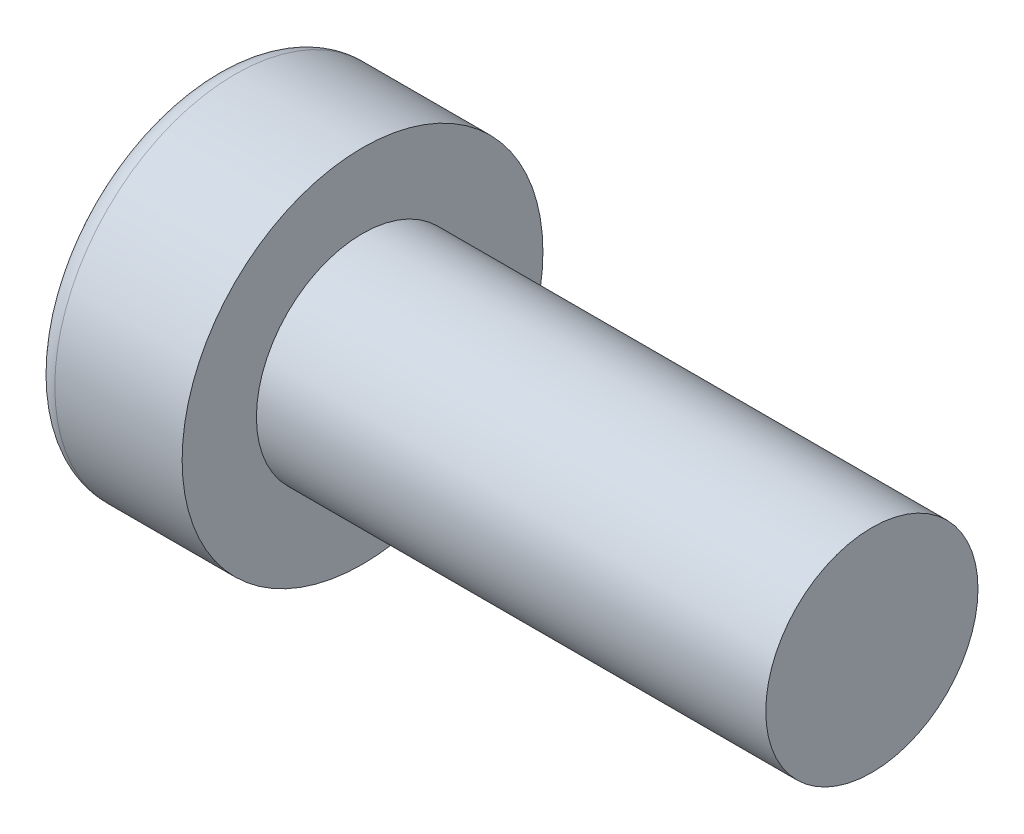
from build123d import *

# Parameters (mm, degrees)
VERRUNDUNG1_R                   = 0.5
SCHNITT_LINEAR_AUSTRAGEN1_DEPTH = 3


with BuildPart() as part:
    # Skizze1 → Rotation1 (revolve)
    with BuildSketch(Plane.XY, mode=Mode.PRIVATE) as rotation1_sk:
        Polygon((-15.5, 0), (-15.5, 4.25), (-12, 4.25), (-12, 2.5), (0, 2.5), (0, 0), align=None)
    revolve(rotation1_sk.sketch.rotate(Axis((-65.011808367, 0, 0), (1, 0, 0)), 90), axis=Axis((-65.011808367, 0, 0), (1, 0, 0)))

    # Verrundung1
    verrundung1_edges = [part.edges().sort_by_distance(p)[0] for p in [
        (-15.5, 0, -4.25),
    ]]
    fillet(verrundung1_edges, radius=VERRUNDUNG1_R)

    # Skizze2 → Schnitt-Linear austragen1 (cut)
    with BuildSketch(Plane.ZY.offset(15.5)):
        Polygon((1.5, 0.866025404), (0, 1.732050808), (-1.5, 0.866025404), (-1.5, -0.866025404), (0, -1.732050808), (1.5, -0.866025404), align=None)
    extrude(amount=-SCHNITT_LINEAR_AUSTRAGEN1_DEPTH, mode=Mode.SUBTRACT)


solid = part.part
